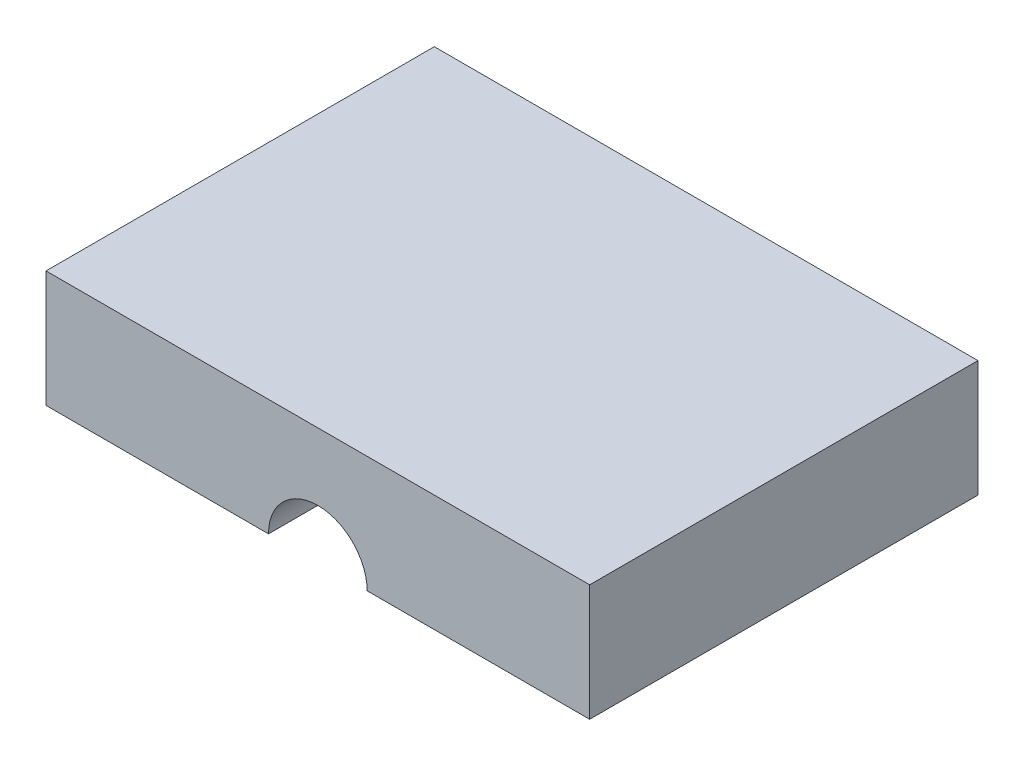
ISO-10303-21;
HEADER;
FILE_DESCRIPTION(('STEP AP214'),'2;1');
FILE_NAME('part.step','',(''),(''),'','','');
FILE_SCHEMA(('AUTOMOTIVE_DESIGN { 1 0 10303 214 1 1 1 1 }'));
ENDSEC;
DATA;
#1=APPLICATION_CONTEXT('core data for automotive mechanical design processes');
#2=APPLICATION_PROTOCOL_DEFINITION('international standard','automotive_design',2000,#1);
#3=PRODUCT_CONTEXT('',#1,'mechanical');
#4=PRODUCT('Part','Part','',(#3));
#5=PRODUCT_RELATED_PRODUCT_CATEGORY('part','',(#4));
#6=PRODUCT_DEFINITION_FORMATION('','',#4);
#7=PRODUCT_DEFINITION_CONTEXT('part definition',#1,'design');
#8=PRODUCT_DEFINITION('design','',#6,#7);
#9=PRODUCT_DEFINITION_SHAPE('','',#8);
#10=(LENGTH_UNIT() NAMED_UNIT(*) SI_UNIT(.MILLI.,.METRE.));
#11=(NAMED_UNIT(*) PLANE_ANGLE_UNIT() SI_UNIT($,.RADIAN.));
#12=(NAMED_UNIT(*) SI_UNIT($,.STERADIAN.) SOLID_ANGLE_UNIT());
#13=UNCERTAINTY_MEASURE_WITH_UNIT(LENGTH_MEASURE(1.E-05),#10,'distance_accuracy_value','');
#14=(GEOMETRIC_REPRESENTATION_CONTEXT(3) GLOBAL_UNCERTAINTY_ASSIGNED_CONTEXT((#13)) GLOBAL_UNIT_ASSIGNED_CONTEXT((#10,
#11,#12)) REPRESENTATION_CONTEXT('',''));
#15=CARTESIAN_POINT('',(0.,0.,0.));
#16=DIRECTION('',(0.,0.,1.));
#17=DIRECTION('',(1.,0.,0.));
#18=AXIS2_PLACEMENT_3D('',#15,#16,#17);
#19=CARTESIAN_POINT('',(0.,0.,50.));
#20=DIRECTION('',(0.,0.,-1.));
#21=DIRECTION('',(-1.,0.,0.));
#22=AXIS2_PLACEMENT_3D('',#19,#20,#21);
#23=CYLINDRICAL_SURFACE('',#22,6.35);
#24=CARTESIAN_POINT('',(0.,0.,0.));
#25=DIRECTION('',(0.,0.,1.));
#26=DIRECTION('',(1.,0.,0.));
#27=AXIS2_PLACEMENT_3D('',#24,#25,#26);
#28=CIRCLE('',#27,6.35);
#29=CARTESIAN_POINT('',(6.35,0.,0.));
#30=VERTEX_POINT('',#29);
#31=CARTESIAN_POINT('',(-6.35,0.,0.));
#32=VERTEX_POINT('',#31);
#33=EDGE_CURVE('E120',#30,#32,#28,.T.);
#34=ORIENTED_EDGE('',*,*,#33,.F.);
#35=DIRECTION('',(0.,0.,-1.));
#36=VECTOR('',#35,1.);
#37=CARTESIAN_POINT('',(6.35,0.,50.));
#38=LINE('',#37,#36);
#39=CARTESIAN_POINT('',(6.35,0.,50.));
#40=VERTEX_POINT('',#39);
#41=EDGE_CURVE('E11',#40,#30,#38,.T.);
#42=ORIENTED_EDGE('',*,*,#41,.F.);
#43=CARTESIAN_POINT('',(0.,0.,50.));
#44=DIRECTION('',(0.,0.,1.));
#45=DIRECTION('',(1.,0.,0.));
#46=AXIS2_PLACEMENT_3D('',#43,#44,#45);
#47=CIRCLE('',#46,6.35);
#48=CARTESIAN_POINT('',(-6.35,0.,50.));
#49=VERTEX_POINT('',#48);
#50=EDGE_CURVE('E145',#40,#49,#47,.T.);
#51=ORIENTED_EDGE('',*,*,#50,.T.);
#52=DIRECTION('',(0.,0.,-1.));
#53=VECTOR('',#52,1.);
#54=CARTESIAN_POINT('',(-6.35,0.,50.));
#55=LINE('',#54,#53);
#56=EDGE_CURVE('E83',#49,#32,#55,.T.);
#57=ORIENTED_EDGE('',*,*,#56,.T.);
#58=EDGE_LOOP('',(#34,#42,#51,#57));
#59=FACE_BOUND('',#58,.T.);
#60=ADVANCED_FACE('F39',(#59),#23,.F.);
#61=CARTESIAN_POINT('',(0.,0.,50.));
#62=DIRECTION('',(0.,1.,0.));
#63=DIRECTION('',(-1.,0.,0.));
#64=AXIS2_PLACEMENT_3D('',#61,#62,#63);
#65=PLANE('',#64);
#66=DIRECTION('',(1.,0.,0.));
#67=VECTOR('',#66,1.);
#68=CARTESIAN_POINT('',(0.,0.,0.));
#69=LINE('',#68,#67);
#70=CARTESIAN_POINT('',(35.,0.,0.));
#71=VERTEX_POINT('',#70);
#72=EDGE_CURVE('E123',#30,#71,#69,.T.);
#73=ORIENTED_EDGE('',*,*,#72,.T.);
#74=DIRECTION('',(0.,0.,-1.));
#75=VECTOR('',#74,1.);
#76=CARTESIAN_POINT('',(35.,0.,50.));
#77=LINE('',#76,#75);
#78=CARTESIAN_POINT('',(35.,0.,50.));
#79=VERTEX_POINT('',#78);
#80=EDGE_CURVE('E47',#79,#71,#77,.T.);
#81=ORIENTED_EDGE('',*,*,#80,.F.);
#82=DIRECTION('',(1.,0.,0.));
#83=VECTOR('',#82,1.);
#84=CARTESIAN_POINT('',(0.,0.,50.));
#85=LINE('',#84,#83);
#86=EDGE_CURVE('E116',#40,#79,#85,.T.);
#87=ORIENTED_EDGE('',*,*,#86,.F.);
#88=ORIENTED_EDGE('',*,*,#41,.T.);
#89=EDGE_LOOP('',(#73,#81,#87,#88));
#90=FACE_BOUND('',#89,.T.);
#91=ADVANCED_FACE('F140',(#90),#65,.F.);
#92=CARTESIAN_POINT('',(35.,0.,50.));
#93=DIRECTION('',(1.,0.,0.));
#94=DIRECTION('',(0.,0.,-1.));
#95=AXIS2_PLACEMENT_3D('',#92,#93,#94);
#96=PLANE('',#95);
#97=DIRECTION('',(0.,-1.,0.));
#98=VECTOR('',#97,1.);
#99=CARTESIAN_POINT('',(35.,0.,0.));
#100=LINE('',#99,#98);
#101=CARTESIAN_POINT('',(35.,15.,0.));
#102=VERTEX_POINT('',#101);
#103=EDGE_CURVE('E126',#102,#71,#100,.T.);
#104=ORIENTED_EDGE('',*,*,#103,.F.);
#105=DIRECTION('',(0.,0.,-1.));
#106=VECTOR('',#105,1.);
#107=CARTESIAN_POINT('',(35.,15.,50.));
#108=LINE('',#107,#106);
#109=CARTESIAN_POINT('',(35.,15.,50.));
#110=VERTEX_POINT('',#109);
#111=EDGE_CURVE('E105',#110,#102,#108,.T.);
#112=ORIENTED_EDGE('',*,*,#111,.F.);
#113=DIRECTION('',(0.,-1.,0.));
#114=VECTOR('',#113,1.);
#115=CARTESIAN_POINT('',(35.,0.,50.));
#116=LINE('',#115,#114);
#117=EDGE_CURVE('E114',#110,#79,#116,.T.);
#118=ORIENTED_EDGE('',*,*,#117,.T.);
#119=ORIENTED_EDGE('',*,*,#80,.T.);
#120=EDGE_LOOP('',(#104,#112,#118,#119));
#121=FACE_BOUND('',#120,.T.);
#122=ADVANCED_FACE('F137',(#121),#96,.T.);
#123=CARTESIAN_POINT('',(0.,15.,50.));
#124=DIRECTION('',(0.,1.,0.));
#125=DIRECTION('',(-1.,0.,0.));
#126=AXIS2_PLACEMENT_3D('',#123,#124,#125);
#127=PLANE('',#126);
#128=DIRECTION('',(1.,0.,0.));
#129=VECTOR('',#128,1.);
#130=CARTESIAN_POINT('',(0.,15.,0.));
#131=LINE('',#130,#129);
#132=CARTESIAN_POINT('',(-35.,15.,0.));
#133=VERTEX_POINT('',#132);
#134=EDGE_CURVE('E104',#133,#102,#131,.T.);
#135=ORIENTED_EDGE('',*,*,#134,.F.);
#136=DIRECTION('',(0.,0.,-1.));
#137=VECTOR('',#136,1.);
#138=CARTESIAN_POINT('',(-35.,15.,50.));
#139=LINE('',#138,#137);
#140=CARTESIAN_POINT('',(-35.,15.,50.));
#141=VERTEX_POINT('',#140);
#142=EDGE_CURVE('E98',#141,#133,#139,.T.);
#143=ORIENTED_EDGE('',*,*,#142,.F.);
#144=DIRECTION('',(1.,0.,0.));
#145=VECTOR('',#144,1.);
#146=CARTESIAN_POINT('',(0.,15.,50.));
#147=LINE('',#146,#145);
#148=EDGE_CURVE('E102',#141,#110,#147,.T.);
#149=ORIENTED_EDGE('',*,*,#148,.T.);
#150=ORIENTED_EDGE('',*,*,#111,.T.);
#151=EDGE_LOOP('',(#135,#143,#149,#150));
#152=FACE_BOUND('',#151,.T.);
#153=ADVANCED_FACE('F100',(#152),#127,.T.);
#154=CARTESIAN_POINT('',(-35.,0.,50.));
#155=DIRECTION('',(1.,0.,0.));
#156=DIRECTION('',(0.,0.,-1.));
#157=AXIS2_PLACEMENT_3D('',#154,#155,#156);
#158=PLANE('',#157);
#159=DIRECTION('',(0.,-1.,0.));
#160=VECTOR('',#159,1.);
#161=CARTESIAN_POINT('',(-35.,0.,0.));
#162=LINE('',#161,#160);
#163=CARTESIAN_POINT('',(-35.,0.,0.));
#164=VERTEX_POINT('',#163);
#165=EDGE_CURVE('E76',#133,#164,#162,.T.);
#166=ORIENTED_EDGE('',*,*,#165,.T.);
#167=DIRECTION('',(0.,0.,-1.));
#168=VECTOR('',#167,1.);
#169=CARTESIAN_POINT('',(-35.,0.,50.));
#170=LINE('',#169,#168);
#171=CARTESIAN_POINT('',(-35.,0.,50.));
#172=VERTEX_POINT('',#171);
#173=EDGE_CURVE('E106',#172,#164,#170,.T.);
#174=ORIENTED_EDGE('',*,*,#173,.F.);
#175=DIRECTION('',(0.,-1.,0.));
#176=VECTOR('',#175,1.);
#177=CARTESIAN_POINT('',(-35.,0.,50.));
#178=LINE('',#177,#176);
#179=EDGE_CURVE('E108',#141,#172,#178,.T.);
#180=ORIENTED_EDGE('',*,*,#179,.F.);
#181=ORIENTED_EDGE('',*,*,#142,.T.);
#182=EDGE_LOOP('',(#166,#174,#180,#181));
#183=FACE_BOUND('',#182,.T.);
#184=ADVANCED_FACE('F109',(#183),#158,.F.);
#185=EDGE_CURVE('E127',#164,#32,#69,.T.);
#186=ORIENTED_EDGE('',*,*,#185,.T.);
#187=ORIENTED_EDGE('',*,*,#56,.F.);
#188=EDGE_CURVE('E55',#172,#49,#85,.T.);
#189=ORIENTED_EDGE('',*,*,#188,.F.);
#190=ORIENTED_EDGE('',*,*,#173,.T.);
#191=EDGE_LOOP('',(#186,#187,#189,#190));
#192=FACE_BOUND('',#191,.T.);
#193=ADVANCED_FACE('F152',(#192),#65,.F.);
#194=CARTESIAN_POINT('',(0.,0.,50.));
#195=DIRECTION('',(0.,0.,1.));
#196=DIRECTION('',(1.,0.,0.));
#197=AXIS2_PLACEMENT_3D('',#194,#195,#196);
#198=PLANE('',#197);
#199=ORIENTED_EDGE('',*,*,#50,.F.);
#200=ORIENTED_EDGE('',*,*,#86,.T.);
#201=ORIENTED_EDGE('',*,*,#117,.F.);
#202=ORIENTED_EDGE('',*,*,#148,.F.);
#203=ORIENTED_EDGE('',*,*,#179,.T.);
#204=ORIENTED_EDGE('',*,*,#188,.T.);
#205=EDGE_LOOP('',(#199,#200,#201,#202,#203,#204));
#206=FACE_BOUND('',#205,.T.);
#207=ADVANCED_FACE('F112',(#206),#198,.T.);
#208=CARTESIAN_POINT('',(0.,0.,0.));
#209=DIRECTION('',(0.,0.,1.));
#210=DIRECTION('',(1.,0.,0.));
#211=AXIS2_PLACEMENT_3D('',#208,#209,#210);
#212=PLANE('',#211);
#213=ORIENTED_EDGE('',*,*,#33,.T.);
#214=ORIENTED_EDGE('',*,*,#185,.F.);
#215=ORIENTED_EDGE('',*,*,#165,.F.);
#216=ORIENTED_EDGE('',*,*,#134,.T.);
#217=ORIENTED_EDGE('',*,*,#103,.T.);
#218=ORIENTED_EDGE('',*,*,#72,.F.);
#219=EDGE_LOOP('',(#213,#214,#215,#216,#217,#218));
#220=FACE_BOUND('',#219,.T.);
#221=ADVANCED_FACE('F142',(#220),#212,.F.);
#222=CLOSED_SHELL('',(#60,#91,#122,#153,#184,#193,#207,#221));
#223=MANIFOLD_SOLID_BREP('B2',#222);
#224=ADVANCED_BREP_SHAPE_REPRESENTATION('',(#18,#223),#14);
#225=SHAPE_DEFINITION_REPRESENTATION(#9,#224);
ENDSEC;
END-ISO-10303-21;
